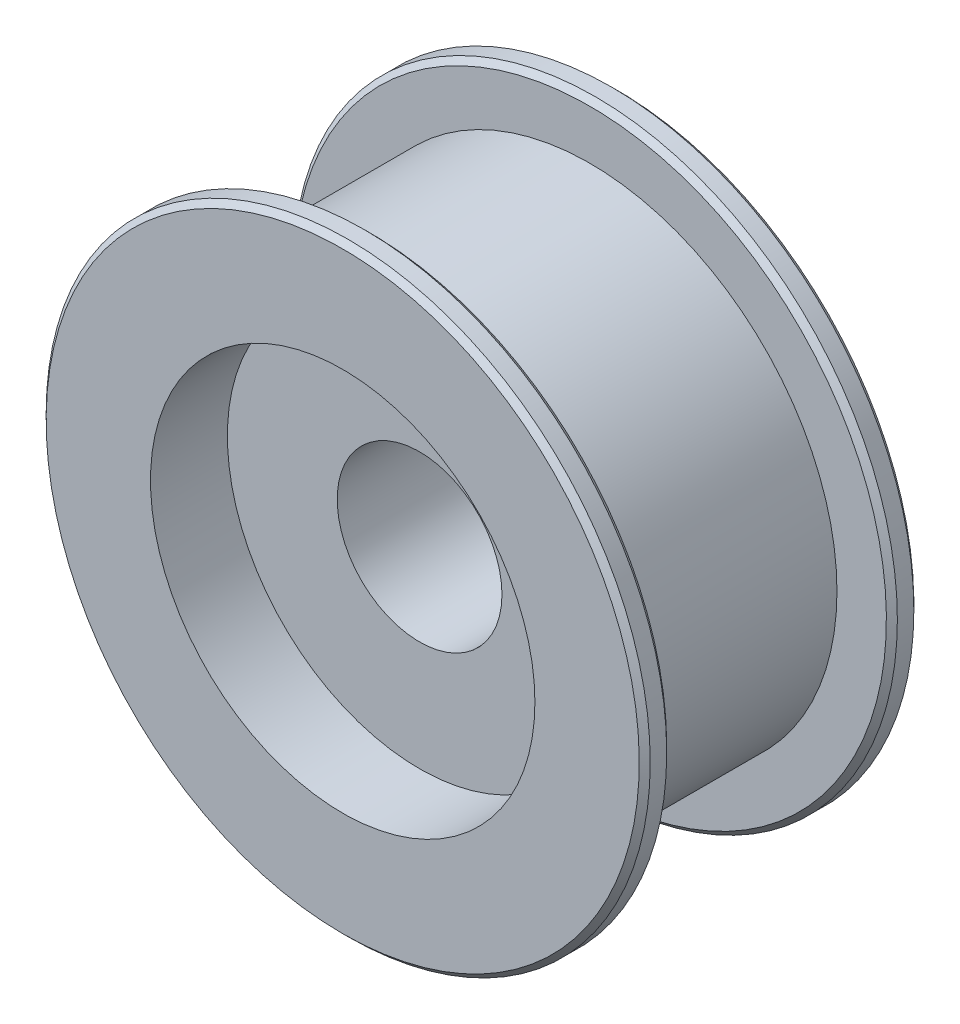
ISO-10303-21;
HEADER;
FILE_DESCRIPTION(('STEP AP214'),'2;1');
FILE_NAME('part.step','',(''),(''),'','','');
FILE_SCHEMA(('AUTOMOTIVE_DESIGN { 1 0 10303 214 1 1 1 1 }'));
ENDSEC;
DATA;
#1=APPLICATION_CONTEXT('core data for automotive mechanical design processes');
#2=APPLICATION_PROTOCOL_DEFINITION('international standard','automotive_design',2000,#1);
#3=PRODUCT_CONTEXT('',#1,'mechanical');
#4=PRODUCT('Part','Part','',(#3));
#5=PRODUCT_RELATED_PRODUCT_CATEGORY('part','',(#4));
#6=PRODUCT_DEFINITION_FORMATION('','',#4);
#7=PRODUCT_DEFINITION_CONTEXT('part definition',#1,'design');
#8=PRODUCT_DEFINITION('design','',#6,#7);
#9=PRODUCT_DEFINITION_SHAPE('','',#8);
#10=(LENGTH_UNIT() NAMED_UNIT(*) SI_UNIT(.MILLI.,.METRE.));
#11=(NAMED_UNIT(*) PLANE_ANGLE_UNIT() SI_UNIT($,.RADIAN.));
#12=(NAMED_UNIT(*) SI_UNIT($,.STERADIAN.) SOLID_ANGLE_UNIT());
#13=UNCERTAINTY_MEASURE_WITH_UNIT(LENGTH_MEASURE(1.E-05),#10,'distance_accuracy_value','');
#14=(GEOMETRIC_REPRESENTATION_CONTEXT(3) GLOBAL_UNCERTAINTY_ASSIGNED_CONTEXT((#13)) GLOBAL_UNIT_ASSIGNED_CONTEXT((#10,
#11,#12)) REPRESENTATION_CONTEXT('',''));
#15=CARTESIAN_POINT('',(0.,0.,0.));
#16=DIRECTION('',(0.,0.,1.));
#17=DIRECTION('',(1.,0.,0.));
#18=AXIS2_PLACEMENT_3D('',#15,#16,#17);
#19=CARTESIAN_POINT('',(0.,-15.9687194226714,5.5));
#20=DIRECTION('',(0.,0.,1.));
#21=DIRECTION('',(0.,1.,0.));
#22=AXIS2_PLACEMENT_3D('',#19,#20,#21);
#23=PLANE('',#22);
#24=CARTESIAN_POINT('',(0.,0.,5.5));
#25=DIRECTION('',(0.,0.,1.));
#26=DIRECTION('',(1.,0.,0.));
#27=AXIS2_PLACEMENT_3D('',#24,#25,#26);
#28=CIRCLE('',#27,7.5);
#29=CARTESIAN_POINT('',(7.5,0.,5.5));
#30=VERTEX_POINT('',#29);
#31=EDGE_CURVE('E58',#30,#30,#28,.T.);
#32=ORIENTED_EDGE('',*,*,#31,.F.);
#33=EDGE_LOOP('',(#32));
#34=FACE_BOUND('',#33,.T.);
#35=CARTESIAN_POINT('',(0.,0.,5.5));
#36=DIRECTION('',(0.,0.,1.));
#37=DIRECTION('',(1.,0.,0.));
#38=AXIS2_PLACEMENT_3D('',#35,#36,#37);
#39=CIRCLE('',#38,17.5);
#40=CARTESIAN_POINT('',(17.5,0.,5.5));
#41=VERTEX_POINT('',#40);
#42=EDGE_CURVE('E52',#41,#41,#39,.T.);
#43=ORIENTED_EDGE('',*,*,#42,.T.);
#44=EDGE_LOOP('',(#43));
#45=FACE_BOUND('',#44,.T.);
#46=ADVANCED_FACE('F12',(#34,#45),#23,.T.);
#47=CARTESIAN_POINT('',(0.,0.,-19.5));
#48=DIRECTION('',(0.,0.,-1.));
#49=DIRECTION('',(0.,-1.,0.));
#50=AXIS2_PLACEMENT_3D('',#47,#48,#49);
#51=CYLINDRICAL_SURFACE('',#50,7.5);
#52=CARTESIAN_POINT('',(0.,0.,-5.5));
#53=DIRECTION('',(0.,0.,1.));
#54=DIRECTION('',(1.,0.,0.));
#55=AXIS2_PLACEMENT_3D('',#52,#53,#54);
#56=CIRCLE('',#55,7.5);
#57=CARTESIAN_POINT('',(7.5,0.,-5.5));
#58=VERTEX_POINT('',#57);
#59=EDGE_CURVE('E61',#58,#58,#56,.T.);
#60=ORIENTED_EDGE('',*,*,#59,.F.);
#61=EDGE_LOOP('',(#60));
#62=FACE_BOUND('',#61,.T.);
#63=ORIENTED_EDGE('',*,*,#31,.T.);
#64=EDGE_LOOP('',(#63));
#65=FACE_BOUND('',#64,.T.);
#66=ADVANCED_FACE('F143',(#62,#65),#51,.F.);
#67=CARTESIAN_POINT('',(0.,-14.,-5.5));
#68=DIRECTION('',(0.,0.,-1.));
#69=DIRECTION('',(0.,-1.,0.));
#70=AXIS2_PLACEMENT_3D('',#67,#68,#69);
#71=PLANE('',#70);
#72=CARTESIAN_POINT('',(0.,0.,-5.5));
#73=DIRECTION('',(0.,0.,-1.));
#74=DIRECTION('',(0.,-1.,0.));
#75=AXIS2_PLACEMENT_3D('',#72,#73,#74);
#76=CIRCLE('',#75,14.);
#77=CARTESIAN_POINT('',(0.,-14.,-5.50000000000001));
#78=VERTEX_POINT('',#77);
#79=EDGE_CURVE('E8',#78,#78,#76,.T.);
#80=ORIENTED_EDGE('',*,*,#79,.T.);
#81=EDGE_LOOP('',(#80));
#82=FACE_BOUND('',#81,.T.);
#83=ORIENTED_EDGE('',*,*,#59,.T.);
#84=EDGE_LOOP('',(#83));
#85=FACE_BOUND('',#84,.T.);
#86=ADVANCED_FACE('F140',(#82,#85),#71,.T.);
#87=CARTESIAN_POINT('',(0.,0.,-19.5));
#88=DIRECTION('',(0.,0.,-1.));
#89=DIRECTION('',(0.,-1.,0.));
#90=AXIS2_PLACEMENT_3D('',#87,#88,#89);
#91=CYLINDRICAL_SURFACE('',#90,14.);
#92=CARTESIAN_POINT('',(0.,0.,-12.5));
#93=DIRECTION('',(0.,0.,-1.));
#94=DIRECTION('',(0.,-1.,0.));
#95=AXIS2_PLACEMENT_3D('',#92,#93,#94);
#96=CIRCLE('',#95,14.);
#97=CARTESIAN_POINT('',(0.,-14.,-12.5));
#98=VERTEX_POINT('',#97);
#99=EDGE_CURVE('E18',#98,#98,#96,.T.);
#100=ORIENTED_EDGE('',*,*,#99,.T.);
#101=EDGE_LOOP('',(#100));
#102=FACE_BOUND('',#101,.T.);
#103=ORIENTED_EDGE('',*,*,#79,.F.);
#104=EDGE_LOOP('',(#103));
#105=FACE_BOUND('',#104,.T.);
#106=ADVANCED_FACE('F133',(#102,#105),#91,.F.);
#107=CARTESIAN_POINT('',(0.,-14.,-12.5));
#108=DIRECTION('',(0.,0.,-1.));
#109=DIRECTION('',(0.,-1.,0.));
#110=AXIS2_PLACEMENT_3D('',#107,#108,#109);
#111=PLANE('',#110);
#112=CARTESIAN_POINT('',(0.,0.,-12.5));
#113=DIRECTION('',(0.,0.,-1.));
#114=DIRECTION('',(0.,-1.,0.));
#115=AXIS2_PLACEMENT_3D('',#112,#113,#114);
#116=CIRCLE('',#115,27.);
#117=CARTESIAN_POINT('',(0.,-27.,-12.5));
#118=VERTEX_POINT('',#117);
#119=EDGE_CURVE('E22',#118,#118,#116,.T.);
#120=ORIENTED_EDGE('',*,*,#119,.T.);
#121=EDGE_LOOP('',(#120));
#122=FACE_BOUND('',#121,.T.);
#123=ORIENTED_EDGE('',*,*,#99,.F.);
#124=EDGE_LOOP('',(#123));
#125=FACE_BOUND('',#124,.T.);
#126=ADVANCED_FACE('F127',(#122,#125),#111,.T.);
#127=CARTESIAN_POINT('',(0.,0.,-12.5));
#128=DIRECTION('',(0.,0.,1.));
#129=DIRECTION('',(0.,1.,0.));
#130=AXIS2_PLACEMENT_3D('',#127,#128,#129);
#131=CONICAL_SURFACE('',#130,27.,0.785398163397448);
#132=CARTESIAN_POINT('',(0.,0.,-12.));
#133=DIRECTION('',(0.,0.,-1.));
#134=DIRECTION('',(0.,-1.,0.));
#135=AXIS2_PLACEMENT_3D('',#132,#133,#134);
#136=CIRCLE('',#135,27.5);
#137=CARTESIAN_POINT('',(0.,-27.5,-12.));
#138=VERTEX_POINT('',#137);
#139=EDGE_CURVE('E26',#138,#138,#136,.T.);
#140=ORIENTED_EDGE('',*,*,#139,.T.);
#141=EDGE_LOOP('',(#140));
#142=FACE_BOUND('',#141,.T.);
#143=ORIENTED_EDGE('',*,*,#119,.F.);
#144=EDGE_LOOP('',(#143));
#145=FACE_BOUND('',#144,.T.);
#146=ADVANCED_FACE('F121',(#142,#145),#131,.T.);
#147=CARTESIAN_POINT('',(0.,0.,-19.5));
#148=DIRECTION('',(0.,0.,-1.));
#149=DIRECTION('',(0.,-1.,0.));
#150=AXIS2_PLACEMENT_3D('',#147,#148,#149);
#151=CYLINDRICAL_SURFACE('',#150,27.5);
#152=CARTESIAN_POINT('',(0.,0.,-10.5));
#153=DIRECTION('',(0.,0.,-1.));
#154=DIRECTION('',(0.,-1.,0.));
#155=AXIS2_PLACEMENT_3D('',#152,#153,#154);
#156=CIRCLE('',#155,27.5);
#157=CARTESIAN_POINT('',(0.,-27.5,-10.5));
#158=VERTEX_POINT('',#157);
#159=EDGE_CURVE('E31',#158,#158,#156,.T.);
#160=ORIENTED_EDGE('',*,*,#159,.T.);
#161=EDGE_LOOP('',(#160));
#162=FACE_BOUND('',#161,.T.);
#163=ORIENTED_EDGE('',*,*,#139,.F.);
#164=EDGE_LOOP('',(#163));
#165=FACE_BOUND('',#164,.T.);
#166=ADVANCED_FACE('F115',(#162,#165),#151,.T.);
#167=CARTESIAN_POINT('',(0.,0.,-10.5));
#168=DIRECTION('',(0.,0.,-1.));
#169=DIRECTION('',(0.,-1.,0.));
#170=AXIS2_PLACEMENT_3D('',#167,#168,#169);
#171=CONICAL_SURFACE('',#170,27.5,0.785398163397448);
#172=CARTESIAN_POINT('',(0.,0.,-10.));
#173=DIRECTION('',(0.,0.,-1.));
#174=DIRECTION('',(0.,-1.,0.));
#175=AXIS2_PLACEMENT_3D('',#172,#173,#174);
#176=CIRCLE('',#175,27.);
#177=CARTESIAN_POINT('',(0.,-27.,-10.));
#178=VERTEX_POINT('',#177);
#179=EDGE_CURVE('E34',#178,#178,#176,.T.);
#180=ORIENTED_EDGE('',*,*,#179,.T.);
#181=EDGE_LOOP('',(#180));
#182=FACE_BOUND('',#181,.T.);
#183=ORIENTED_EDGE('',*,*,#159,.F.);
#184=EDGE_LOOP('',(#183));
#185=FACE_BOUND('',#184,.T.);
#186=ADVANCED_FACE('F109',(#182,#185),#171,.T.);
#187=CARTESIAN_POINT('',(0.,-22.9,-10.));
#188=DIRECTION('',(0.,0.,1.));
#189=DIRECTION('',(0.,1.,0.));
#190=AXIS2_PLACEMENT_3D('',#187,#188,#189);
#191=PLANE('',#190);
#192=CARTESIAN_POINT('',(0.,0.,-10.));
#193=DIRECTION('',(0.,0.,1.));
#194=DIRECTION('',(1.,0.,0.));
#195=AXIS2_PLACEMENT_3D('',#192,#193,#194);
#196=CIRCLE('',#195,22.5);
#197=CARTESIAN_POINT('',(22.5,0.,-10.));
#198=VERTEX_POINT('',#197);
#199=EDGE_CURVE('E55',#198,#198,#196,.T.);
#200=ORIENTED_EDGE('',*,*,#199,.F.);
#201=EDGE_LOOP('',(#200));
#202=FACE_BOUND('',#201,.T.);
#203=ORIENTED_EDGE('',*,*,#179,.F.);
#204=EDGE_LOOP('',(#203));
#205=FACE_BOUND('',#204,.T.);
#206=ADVANCED_FACE('F103',(#202,#205),#191,.T.);
#207=CARTESIAN_POINT('',(0.,0.,-19.5));
#208=DIRECTION('',(0.,0.,-1.));
#209=DIRECTION('',(0.,-1.,0.));
#210=AXIS2_PLACEMENT_3D('',#207,#208,#209);
#211=CYLINDRICAL_SURFACE('',#210,22.5);
#212=CARTESIAN_POINT('',(0.,0.,10.));
#213=DIRECTION('',(0.,0.,1.));
#214=DIRECTION('',(1.,0.,0.));
#215=AXIS2_PLACEMENT_3D('',#212,#213,#214);
#216=CIRCLE('',#215,22.5);
#217=CARTESIAN_POINT('',(22.5,0.,10.));
#218=VERTEX_POINT('',#217);
#219=EDGE_CURVE('E49',#218,#218,#216,.T.);
#220=ORIENTED_EDGE('',*,*,#219,.F.);
#221=EDGE_LOOP('',(#220));
#222=FACE_BOUND('',#221,.T.);
#223=ORIENTED_EDGE('',*,*,#199,.T.);
#224=EDGE_LOOP('',(#223));
#225=FACE_BOUND('',#224,.T.);
#226=ADVANCED_FACE('F97',(#222,#225),#211,.T.);
#227=CARTESIAN_POINT('',(0.,-22.9,10.));
#228=DIRECTION('',(0.,0.,-1.));
#229=DIRECTION('',(0.,-1.,0.));
#230=AXIS2_PLACEMENT_3D('',#227,#228,#229);
#231=PLANE('',#230);
#232=CARTESIAN_POINT('',(0.,0.,10.));
#233=DIRECTION('',(0.,0.,-1.));
#234=DIRECTION('',(0.,-1.,0.));
#235=AXIS2_PLACEMENT_3D('',#232,#233,#234);
#236=CIRCLE('',#235,27.);
#237=CARTESIAN_POINT('',(0.,-27.,9.99999999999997));
#238=VERTEX_POINT('',#237);
#239=EDGE_CURVE('E37',#238,#238,#236,.T.);
#240=ORIENTED_EDGE('',*,*,#239,.T.);
#241=EDGE_LOOP('',(#240));
#242=FACE_BOUND('',#241,.T.);
#243=ORIENTED_EDGE('',*,*,#219,.T.);
#244=EDGE_LOOP('',(#243));
#245=FACE_BOUND('',#244,.T.);
#246=ADVANCED_FACE('F91',(#242,#245),#231,.T.);
#247=CARTESIAN_POINT('',(0.,0.,10.));
#248=DIRECTION('',(0.,0.,1.));
#249=DIRECTION('',(0.,1.,0.));
#250=AXIS2_PLACEMENT_3D('',#247,#248,#249);
#251=CONICAL_SURFACE('',#250,27.,0.785398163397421);
#252=CARTESIAN_POINT('',(0.,0.,10.5));
#253=DIRECTION('',(0.,0.,-1.));
#254=DIRECTION('',(0.,-1.,0.));
#255=AXIS2_PLACEMENT_3D('',#252,#253,#254);
#256=CIRCLE('',#255,27.5);
#257=CARTESIAN_POINT('',(0.,-27.5,10.5));
#258=VERTEX_POINT('',#257);
#259=EDGE_CURVE('E40',#258,#258,#256,.T.);
#260=ORIENTED_EDGE('',*,*,#259,.T.);
#261=EDGE_LOOP('',(#260));
#262=FACE_BOUND('',#261,.T.);
#263=ORIENTED_EDGE('',*,*,#239,.F.);
#264=EDGE_LOOP('',(#263));
#265=FACE_BOUND('',#264,.T.);
#266=ADVANCED_FACE('F85',(#262,#265),#251,.T.);
#267=CARTESIAN_POINT('',(0.,0.,-19.5));
#268=DIRECTION('',(0.,0.,-1.));
#269=DIRECTION('',(0.,-1.,0.));
#270=AXIS2_PLACEMENT_3D('',#267,#268,#269);
#271=CYLINDRICAL_SURFACE('',#270,27.5);
#272=CARTESIAN_POINT('',(0.,0.,12.));
#273=DIRECTION('',(0.,0.,-1.));
#274=DIRECTION('',(0.,-1.,0.));
#275=AXIS2_PLACEMENT_3D('',#272,#273,#274);
#276=CIRCLE('',#275,27.5);
#277=CARTESIAN_POINT('',(0.,-27.5,12.));
#278=VERTEX_POINT('',#277);
#279=EDGE_CURVE('E43',#278,#278,#276,.T.);
#280=ORIENTED_EDGE('',*,*,#279,.T.);
#281=EDGE_LOOP('',(#280));
#282=FACE_BOUND('',#281,.T.);
#283=ORIENTED_EDGE('',*,*,#259,.F.);
#284=EDGE_LOOP('',(#283));
#285=FACE_BOUND('',#284,.T.);
#286=ADVANCED_FACE('F79',(#282,#285),#271,.T.);
#287=CARTESIAN_POINT('',(0.,0.,12.));
#288=DIRECTION('',(0.,0.,-1.));
#289=DIRECTION('',(0.,-1.,0.));
#290=AXIS2_PLACEMENT_3D('',#287,#288,#289);
#291=CONICAL_SURFACE('',#290,27.5,0.785398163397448);
#292=CARTESIAN_POINT('',(0.,0.,12.5));
#293=DIRECTION('',(0.,0.,-1.));
#294=DIRECTION('',(0.,-1.,0.));
#295=AXIS2_PLACEMENT_3D('',#292,#293,#294);
#296=CIRCLE('',#295,27.);
#297=CARTESIAN_POINT('',(0.,-27.,12.5));
#298=VERTEX_POINT('',#297);
#299=EDGE_CURVE('E46',#298,#298,#296,.T.);
#300=ORIENTED_EDGE('',*,*,#299,.T.);
#301=EDGE_LOOP('',(#300));
#302=FACE_BOUND('',#301,.T.);
#303=ORIENTED_EDGE('',*,*,#279,.F.);
#304=EDGE_LOOP('',(#303));
#305=FACE_BOUND('',#304,.T.);
#306=ADVANCED_FACE('F73',(#302,#305),#291,.T.);
#307=CARTESIAN_POINT('',(0.,-18.0773502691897,12.5));
#308=DIRECTION('',(0.,0.,1.));
#309=DIRECTION('',(0.,1.,0.));
#310=AXIS2_PLACEMENT_3D('',#307,#308,#309);
#311=PLANE('',#310);
#312=CARTESIAN_POINT('',(0.,0.,12.5));
#313=DIRECTION('',(0.,0.,1.));
#314=DIRECTION('',(1.,0.,0.));
#315=AXIS2_PLACEMENT_3D('',#312,#313,#314);
#316=CIRCLE('',#315,17.5);
#317=CARTESIAN_POINT('',(17.5,0.,12.5));
#318=VERTEX_POINT('',#317);
#319=EDGE_CURVE('E64',#318,#318,#316,.T.);
#320=ORIENTED_EDGE('',*,*,#319,.F.);
#321=EDGE_LOOP('',(#320));
#322=FACE_BOUND('',#321,.T.);
#323=ORIENTED_EDGE('',*,*,#299,.F.);
#324=EDGE_LOOP('',(#323));
#325=FACE_BOUND('',#324,.T.);
#326=ADVANCED_FACE('F70',(#322,#325),#311,.T.);
#327=CARTESIAN_POINT('',(0.,0.,-19.5));
#328=DIRECTION('',(0.,0.,-1.));
#329=DIRECTION('',(0.,-1.,0.));
#330=AXIS2_PLACEMENT_3D('',#327,#328,#329);
#331=CYLINDRICAL_SURFACE('',#330,17.5);
#332=ORIENTED_EDGE('',*,*,#42,.F.);
#333=EDGE_LOOP('',(#332));
#334=FACE_BOUND('',#333,.T.);
#335=ORIENTED_EDGE('',*,*,#319,.T.);
#336=EDGE_LOOP('',(#335));
#337=FACE_BOUND('',#336,.T.);
#338=ADVANCED_FACE('F68',(#334,#337),#331,.F.);
#339=CLOSED_SHELL('',(#46,#66,#86,#106,#126,#146,#166,#186,#206,#226,#246,#266,#286,#306,#326,#338));
#340=MANIFOLD_SOLID_BREP('B1',#339);
#341=ADVANCED_BREP_SHAPE_REPRESENTATION('',(#18,#340),#14);
#342=SHAPE_DEFINITION_REPRESENTATION(#9,#341);
ENDSEC;
END-ISO-10303-21;
